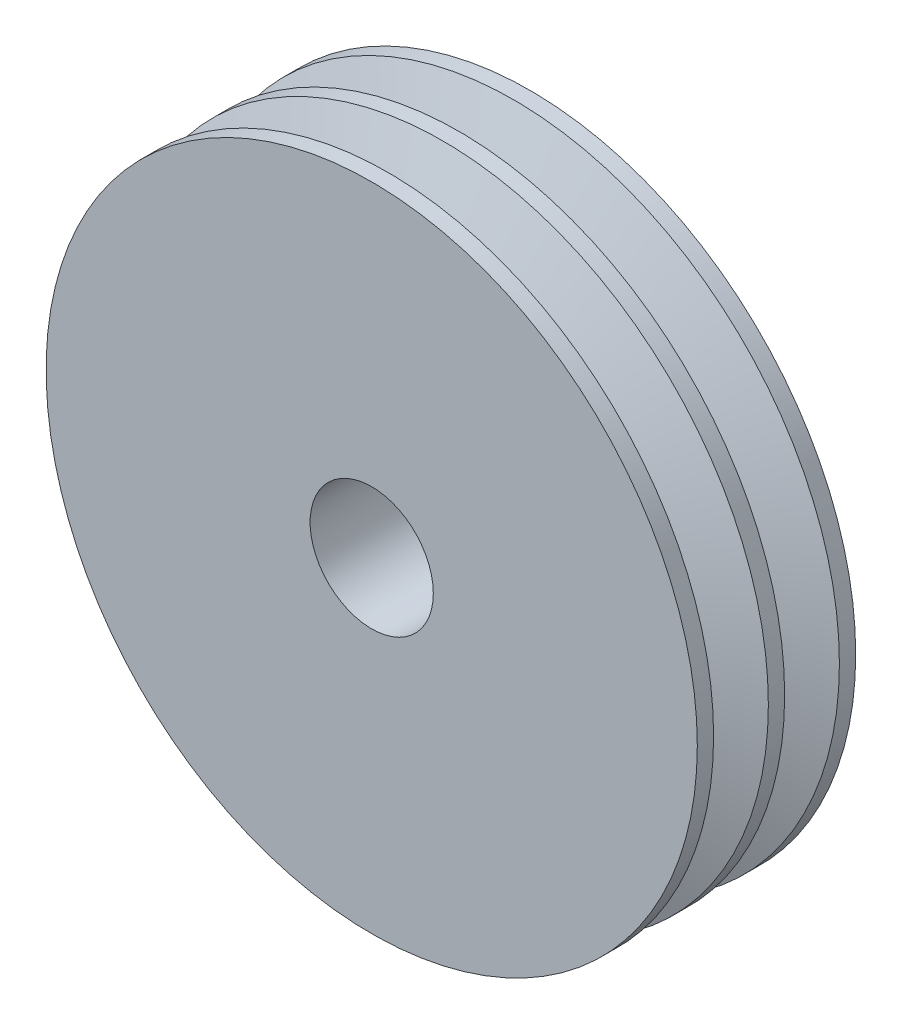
ISO-10303-21;
HEADER;
FILE_DESCRIPTION(('STEP AP214'),'2;1');
FILE_NAME('part.step','',(''),(''),'','','');
FILE_SCHEMA(('AUTOMOTIVE_DESIGN { 1 0 10303 214 1 1 1 1 }'));
ENDSEC;
DATA;
#1=APPLICATION_CONTEXT('core data for automotive mechanical design processes');
#2=APPLICATION_PROTOCOL_DEFINITION('international standard','automotive_design',2000,#1);
#3=PRODUCT_CONTEXT('',#1,'mechanical');
#4=PRODUCT('Part','Part','',(#3));
#5=PRODUCT_RELATED_PRODUCT_CATEGORY('part','',(#4));
#6=PRODUCT_DEFINITION_FORMATION('','',#4);
#7=PRODUCT_DEFINITION_CONTEXT('part definition',#1,'design');
#8=PRODUCT_DEFINITION('design','',#6,#7);
#9=PRODUCT_DEFINITION_SHAPE('','',#8);
#10=(LENGTH_UNIT() NAMED_UNIT(*) SI_UNIT(.MILLI.,.METRE.));
#11=(NAMED_UNIT(*) PLANE_ANGLE_UNIT() SI_UNIT($,.RADIAN.));
#12=(NAMED_UNIT(*) SI_UNIT($,.STERADIAN.) SOLID_ANGLE_UNIT());
#13=UNCERTAINTY_MEASURE_WITH_UNIT(LENGTH_MEASURE(1.E-05),#10,'distance_accuracy_value','');
#14=(GEOMETRIC_REPRESENTATION_CONTEXT(3) GLOBAL_UNCERTAINTY_ASSIGNED_CONTEXT((#13)) GLOBAL_UNIT_ASSIGNED_CONTEXT((#10,
#11,#12)) REPRESENTATION_CONTEXT('',''));
#15=CARTESIAN_POINT('',(0.,0.,0.));
#16=DIRECTION('',(0.,0.,1.));
#17=DIRECTION('',(1.,0.,0.));
#18=AXIS2_PLACEMENT_3D('',#15,#16,#17);
#19=CARTESIAN_POINT('',(0.,0.,3.67693351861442));
#20=DIRECTION('',(0.,0.,-0.999999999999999));
#21=DIRECTION('',(-1.,0.,0.));
#22=AXIS2_PLACEMENT_3D('',#19,#20,#21);
#23=CONICAL_SURFACE('',#22,146.84375,1.22173047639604);
#24=CARTESIAN_POINT('',(0.,0.,12.3439747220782));
#25=DIRECTION('',(0.,0.,0.999999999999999));
#26=DIRECTION('',(1.,0.,0.));
#27=AXIS2_PLACEMENT_3D('',#24,#25,#26);
#28=CIRCLE('',#27,123.03125);
#29=CARTESIAN_POINT('',(-123.03125,0.,12.3439747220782));
#30=VERTEX_POINT('',#29);
#31=EDGE_CURVE('E10',#30,#30,#28,.T.);
#32=CARTESIAN_POINT('',(0.,0.,3.67693351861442));
#33=DIRECTION('',(0.,0.,0.999999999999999));
#34=DIRECTION('',(1.,0.,0.));
#35=AXIS2_PLACEMENT_3D('',#32,#33,#34);
#36=CIRCLE('',#35,146.84375);
#37=CARTESIAN_POINT('',(-146.84375,0.,3.67693351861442));
#38=VERTEX_POINT('',#37);
#39=EDGE_CURVE('E55',#38,#38,#36,.T.);
#40=CARTESIAN_POINT('',(-123.03125,0.,12.3439747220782));
#41=CARTESIAN_POINT('',(-123.279296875,0.,12.2536930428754));
#42=CARTESIAN_POINT('',(-123.52734375,0.,12.1634113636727));
#43=CARTESIAN_POINT('',(-124.0234375,0.,11.9828480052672));
#44=CARTESIAN_POINT('',(-124.271484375,0.,11.8925663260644));
#45=CARTESIAN_POINT('',(-124.767578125,0.,11.7120029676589));
#46=CARTESIAN_POINT('',(-125.015625,0.,11.6217212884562));
#47=CARTESIAN_POINT('',(-125.51171875,0.,11.4411579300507));
#48=CARTESIAN_POINT('',(-125.759765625,0.,11.3508762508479));
#49=CARTESIAN_POINT('',(-126.255859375,0.,11.1703128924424));
#50=CARTESIAN_POINT('',(-126.50390625,0.,11.0800312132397));
#51=CARTESIAN_POINT('',(-127.,0.,10.8994678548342));
#52=CARTESIAN_POINT('',(-127.248046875,0.,10.8091861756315));
#53=CARTESIAN_POINT('',(-127.744140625,0.,10.628622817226));
#54=CARTESIAN_POINT('',(-127.9921875,0.,10.5383411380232));
#55=CARTESIAN_POINT('',(-128.48828125,0.,10.3577777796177));
#56=CARTESIAN_POINT('',(-128.736328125,0.,10.267496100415));
#57=CARTESIAN_POINT('',(-129.232421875,0.,10.0869327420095));
#58=CARTESIAN_POINT('',(-129.48046875,0.,9.99665106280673));
#59=CARTESIAN_POINT('',(-129.9765625,0.,9.81608770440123));
#60=CARTESIAN_POINT('',(-130.224609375,0.,9.72580602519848));
#61=CARTESIAN_POINT('',(-130.720703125,0.,9.54524266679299));
#62=CARTESIAN_POINT('',(-130.96875,0.,9.45496098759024));
#63=CARTESIAN_POINT('',(-131.46484375,0.,9.27439762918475));
#64=CARTESIAN_POINT('',(-131.712890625,0.,9.184115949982));
#65=CARTESIAN_POINT('',(-132.208984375,0.,9.00355259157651));
#66=CARTESIAN_POINT('',(-132.45703125,0.,8.91327091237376));
#67=CARTESIAN_POINT('',(-132.953125,0.,8.73270755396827));
#68=CARTESIAN_POINT('',(-133.201171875,0.,8.64242587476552));
#69=CARTESIAN_POINT('',(-133.697265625,0.,8.46186251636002));
#70=CARTESIAN_POINT('',(-133.9453125,0.,8.37158083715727));
#71=CARTESIAN_POINT('',(-134.44140625,0.,8.19101747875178));
#72=CARTESIAN_POINT('',(-134.689453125,0.,8.10073579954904));
#73=CARTESIAN_POINT('',(-135.185546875,0.,7.92017244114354));
#74=CARTESIAN_POINT('',(-135.43359375,0.,7.82989076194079));
#75=CARTESIAN_POINT('',(-135.9296875,0.,7.6493274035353));
#76=CARTESIAN_POINT('',(-136.177734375,0.,7.55904572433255));
#77=CARTESIAN_POINT('',(-136.673828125,0.,7.37848236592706));
#78=CARTESIAN_POINT('',(-136.921875,0.,7.28820068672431));
#79=CARTESIAN_POINT('',(-137.41796875,0.,7.10763732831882));
#80=CARTESIAN_POINT('',(-137.666015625,0.,7.01735564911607));
#81=CARTESIAN_POINT('',(-138.162109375,0.,6.83679229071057));
#82=CARTESIAN_POINT('',(-138.41015625,0.,6.74651061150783));
#83=CARTESIAN_POINT('',(-138.90625,0.,6.56594725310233));
#84=CARTESIAN_POINT('',(-139.154296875,0.,6.47566557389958));
#85=CARTESIAN_POINT('',(-139.650390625,0.,6.29510221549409));
#86=CARTESIAN_POINT('',(-139.8984375,0.,6.20482053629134));
#87=CARTESIAN_POINT('',(-140.39453125,0.,6.02425717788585));
#88=CARTESIAN_POINT('',(-140.642578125,0.,5.9339754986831));
#89=CARTESIAN_POINT('',(-141.138671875,0.,5.75341214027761));
#90=CARTESIAN_POINT('',(-141.38671875,0.,5.66313046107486));
#91=CARTESIAN_POINT('',(-141.8828125,0.,5.48256710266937));
#92=CARTESIAN_POINT('',(-142.130859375,0.,5.39228542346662));
#93=CARTESIAN_POINT('',(-142.626953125,0.,5.21172206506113));
#94=CARTESIAN_POINT('',(-142.875,0.,5.12144038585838));
#95=CARTESIAN_POINT('',(-143.37109375,0.,4.94087702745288));
#96=CARTESIAN_POINT('',(-143.619140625,0.,4.85059534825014));
#97=CARTESIAN_POINT('',(-144.115234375,0.,4.67003198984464));
#98=CARTESIAN_POINT('',(-144.36328125,0.,4.57975031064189));
#99=CARTESIAN_POINT('',(-144.859375,0.,4.3991869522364));
#100=CARTESIAN_POINT('',(-145.107421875,0.,4.30890527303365));
#101=CARTESIAN_POINT('',(-145.603515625,0.,4.12834191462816));
#102=CARTESIAN_POINT('',(-145.8515625,0.,4.03806023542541));
#103=CARTESIAN_POINT('',(-146.34765625,0.,3.85749687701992));
#104=CARTESIAN_POINT('',(-146.595703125,0.,3.76721519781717));
#105=CARTESIAN_POINT('',(-146.84375,0.,3.67693351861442));
#106=B_SPLINE_CURVE_WITH_KNOTS('',3,(#40,#41,#42,#43,#44,#45,#46,#47,#48,#49,#50,#51,#52,#53,
#54,#55,#56,#57,#58,#59,#60,#61,#62,#63,#64,#65,#66,#67,#68,#69,#70,#71,#72,#73,#74,#75,#76,#77,
#78,#79,#80,#81,#82,#83,#84,#85,#86,#87,#88,#89,#90,#91,#92,#93,#94,#95,#96,#97,#98,#99,#100,
#101,#102,#103,#104,#105),.UNSPECIFIED.,.F.,.F.,(4,2,2,2,2,2,2,2,2,2,2,2,2,2,2,2,2,2,2,2,2,2,2,
2,2,2,2,2,2,2,2,2,4),(0.,0.791897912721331,1.58379582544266,2.37569373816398,3.16759165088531,
3.95948956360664,4.75138747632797,5.54328538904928,6.33518330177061,7.12708121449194,
7.91897912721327,8.7108770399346,9.50277495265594,10.2946728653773,11.0865707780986,
11.8784686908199,12.6703666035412,13.4622645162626,14.2541624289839,15.0460603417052,
15.8379582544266,16.6298561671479,17.4217540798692,18.2136519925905,19.0055499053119,
19.7974478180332,20.5893457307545,21.3812436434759,22.1731415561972,22.9650394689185,
23.7569373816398,24.5488352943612,25.3407332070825),.UNSPECIFIED.);
#107=EDGE_CURVE('BSEAM15',#30,#38,#106,.T.);
#108=ORIENTED_EDGE('',*,*,#31,.F.);
#109=ORIENTED_EDGE('',*,*,#39,.T.);
#110=ORIENTED_EDGE('',*,*,#107,.T.);
#111=ORIENTED_EDGE('',*,*,#107,.F.);
#112=EDGE_LOOP('',(#108,#110,#109,#111));
#113=FACE_BOUND('',#112,.T.);
#114=ADVANCED_FACE('F15',(#113),#23,.T.);
#115=CARTESIAN_POINT('',(0.,0.,0.));
#116=DIRECTION('',(0.,0.,0.999999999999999));
#117=DIRECTION('',(1.,0.,0.));
#118=AXIS2_PLACEMENT_3D('',#115,#116,#117);
#119=CYLINDRICAL_SURFACE('',#118,123.03125);
#120=CARTESIAN_POINT('',(0.,0.,19.6978417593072));
#121=DIRECTION('',(0.,0.,0.999999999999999));
#122=DIRECTION('',(1.,0.,0.));
#123=AXIS2_PLACEMENT_3D('',#120,#121,#122);
#124=CIRCLE('',#123,123.03125);
#125=CARTESIAN_POINT('',(123.03125,0.,19.6978417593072));
#126=VERTEX_POINT('',#125);
#127=EDGE_CURVE('E21',#126,#126,#124,.T.);
#128=ORIENTED_EDGE('',*,*,#127,.F.);
#129=EDGE_LOOP('',(#128));
#130=FACE_BOUND('',#129,.T.);
#131=ORIENTED_EDGE('',*,*,#31,.T.);
#132=EDGE_LOOP('',(#131));
#133=FACE_BOUND('',#132,.T.);
#134=ADVANCED_FACE('F116',(#130,#133),#119,.T.);
#135=CARTESIAN_POINT('',(0.,0.,19.6978417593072));
#136=DIRECTION('',(0.,0.,0.999999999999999));
#137=DIRECTION('',(1.,0.,0.));
#138=AXIS2_PLACEMENT_3D('',#135,#136,#137);
#139=CONICAL_SURFACE('',#138,123.03125,1.22173047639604);
#140=CARTESIAN_POINT('',(0.,0.,28.364882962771));
#141=DIRECTION('',(0.,0.,0.999999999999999));
#142=DIRECTION('',(1.,0.,0.));
#143=AXIS2_PLACEMENT_3D('',#140,#141,#142);
#144=CIRCLE('',#143,146.84375);
#145=CARTESIAN_POINT('',(146.84375,0.,28.364882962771));
#146=VERTEX_POINT('',#145);
#147=EDGE_CURVE('E25',#146,#146,#144,.T.);
#148=CARTESIAN_POINT('',(146.84375,0.,28.364882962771));
#149=CARTESIAN_POINT('',(146.595703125,0.,28.2746012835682));
#150=CARTESIAN_POINT('',(146.34765625,0.,28.1843196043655));
#151=CARTESIAN_POINT('',(145.8515625,0.,28.00375624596));
#152=CARTESIAN_POINT('',(145.603515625,0.,27.9134745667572));
#153=CARTESIAN_POINT('',(145.107421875,0.,27.7329112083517));
#154=CARTESIAN_POINT('',(144.859375,0.,27.642629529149));
#155=CARTESIAN_POINT('',(144.36328125,0.,27.4620661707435));
#156=CARTESIAN_POINT('',(144.115234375,0.,27.3717844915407));
#157=CARTESIAN_POINT('',(143.619140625,0.,27.1912211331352));
#158=CARTESIAN_POINT('',(143.37109375,0.,27.1009394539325));
#159=CARTESIAN_POINT('',(142.875,0.,26.920376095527));
#160=CARTESIAN_POINT('',(142.626953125,0.,26.8300944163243));
#161=CARTESIAN_POINT('',(142.130859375,0.,26.6495310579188));
#162=CARTESIAN_POINT('',(141.8828125,0.,26.559249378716));
#163=CARTESIAN_POINT('',(141.38671875,0.,26.3786860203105));
#164=CARTESIAN_POINT('',(141.138671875,0.,26.2884043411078));
#165=CARTESIAN_POINT('',(140.642578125,0.,26.1078409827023));
#166=CARTESIAN_POINT('',(140.39453125,0.,26.0175593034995));
#167=CARTESIAN_POINT('',(139.8984375,0.,25.836995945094));
#168=CARTESIAN_POINT('',(139.650390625,0.,25.7467142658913));
#169=CARTESIAN_POINT('',(139.154296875,0.,25.5661509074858));
#170=CARTESIAN_POINT('',(138.90625,0.,25.475869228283));
#171=CARTESIAN_POINT('',(138.41015625,0.,25.2953058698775));
#172=CARTESIAN_POINT('',(138.162109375,0.,25.2050241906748));
#173=CARTESIAN_POINT('',(137.666015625,0.,25.0244608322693));
#174=CARTESIAN_POINT('',(137.41796875,0.,24.9341791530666));
#175=CARTESIAN_POINT('',(136.921875,0.,24.7536157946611));
#176=CARTESIAN_POINT('',(136.673828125,0.,24.6633341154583));
#177=CARTESIAN_POINT('',(136.177734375,0.,24.4827707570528));
#178=CARTESIAN_POINT('',(135.9296875,0.,24.3924890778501));
#179=CARTESIAN_POINT('',(135.43359375,0.,24.2119257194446));
#180=CARTESIAN_POINT('',(135.185546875,0.,24.1216440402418));
#181=CARTESIAN_POINT('',(134.689453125,0.,23.9410806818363));
#182=CARTESIAN_POINT('',(134.44140625,0.,23.8507990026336));
#183=CARTESIAN_POINT('',(133.9453125,0.,23.6702356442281));
#184=CARTESIAN_POINT('',(133.697265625,0.,23.5799539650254));
#185=CARTESIAN_POINT('',(133.201171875,0.,23.3993906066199));
#186=CARTESIAN_POINT('',(132.953125,0.,23.3091089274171));
#187=CARTESIAN_POINT('',(132.45703125,0.,23.1285455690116));
#188=CARTESIAN_POINT('',(132.208984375,0.,23.0382638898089));
#189=CARTESIAN_POINT('',(131.712890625,0.,22.8577005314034));
#190=CARTESIAN_POINT('',(131.46484375,0.,22.7674188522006));
#191=CARTESIAN_POINT('',(130.96875,0.,22.5868554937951));
#192=CARTESIAN_POINT('',(130.720703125,0.,22.4965738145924));
#193=CARTESIAN_POINT('',(130.224609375,0.,22.3160104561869));
#194=CARTESIAN_POINT('',(129.9765625,0.,22.2257287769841));
#195=CARTESIAN_POINT('',(129.48046875,0.,22.0451654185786));
#196=CARTESIAN_POINT('',(129.232421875,0.,21.9548837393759));
#197=CARTESIAN_POINT('',(128.736328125,0.,21.7743203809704));
#198=CARTESIAN_POINT('',(128.48828125,0.,21.6840387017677));
#199=CARTESIAN_POINT('',(127.9921875,0.,21.5034753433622));
#200=CARTESIAN_POINT('',(127.744140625,0.,21.4131936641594));
#201=CARTESIAN_POINT('',(127.248046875,0.,21.2326303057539));
#202=CARTESIAN_POINT('',(127.,0.,21.1423486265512));
#203=CARTESIAN_POINT('',(126.50390625,0.,20.9617852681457));
#204=CARTESIAN_POINT('',(126.255859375,0.,20.8715035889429));
#205=CARTESIAN_POINT('',(125.759765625,0.,20.6909402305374));
#206=CARTESIAN_POINT('',(125.51171875,0.,20.6006585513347));
#207=CARTESIAN_POINT('',(125.015625,0.,20.4200951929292));
#208=CARTESIAN_POINT('',(124.767578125,0.,20.3298135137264));
#209=CARTESIAN_POINT('',(124.271484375,0.,20.149250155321));
#210=CARTESIAN_POINT('',(124.0234375,0.,20.0589684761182));
#211=CARTESIAN_POINT('',(123.52734375,0.,19.8784051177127));
#212=CARTESIAN_POINT('',(123.279296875,0.,19.78812343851));
#213=CARTESIAN_POINT('',(123.03125,0.,19.6978417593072));
#214=B_SPLINE_CURVE_WITH_KNOTS('',3,(#148,#149,#150,#151,#152,#153,#154,#155,#156,#157,#158,
#159,#160,#161,#162,#163,#164,#165,#166,#167,#168,#169,#170,#171,#172,#173,#174,#175,#176,#177,
#178,#179,#180,#181,#182,#183,#184,#185,#186,#187,#188,#189,#190,#191,#192,#193,#194,#195,#196,
#197,#198,#199,#200,#201,#202,#203,#204,#205,#206,#207,#208,#209,#210,#211,#212,#213),
.UNSPECIFIED.,.F.,.F.,(4,2,2,2,2,2,2,2,2,2,2,2,2,2,2,2,2,2,2,2,2,2,2,2,2,2,2,2,2,2,2,2,4),(0.,
0.791897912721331,1.58379582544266,2.37569373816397,3.1675916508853,3.95948956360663,
4.75138747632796,5.54328538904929,6.33518330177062,7.12708121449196,7.91897912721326,
8.71087703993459,9.50277495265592,10.2946728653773,11.0865707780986,11.8784686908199,
12.6703666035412,13.4622645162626,14.2541624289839,15.0460603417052,15.8379582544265,
16.6298561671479,17.4217540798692,18.2136519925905,19.0055499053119,19.7974478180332,
20.5893457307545,21.3812436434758,22.1731415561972,22.9650394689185,23.7569373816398,
24.5488352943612,25.3407332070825),.UNSPECIFIED.);
#215=EDGE_CURVE('BSEAM111',#146,#126,#214,.T.);
#216=ORIENTED_EDGE('',*,*,#147,.F.);
#217=ORIENTED_EDGE('',*,*,#127,.T.);
#218=ORIENTED_EDGE('',*,*,#215,.T.);
#219=ORIENTED_EDGE('',*,*,#215,.F.);
#220=EDGE_LOOP('',(#216,#218,#217,#219));
#221=FACE_BOUND('',#220,.T.);
#222=ADVANCED_FACE('F111',(#221),#139,.T.);
#223=CARTESIAN_POINT('',(0.,0.,0.));
#224=DIRECTION('',(0.,0.,0.999999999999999));
#225=DIRECTION('',(1.,0.,0.));
#226=AXIS2_PLACEMENT_3D('',#223,#224,#225);
#227=CYLINDRICAL_SURFACE('',#226,146.84375);
#228=CARTESIAN_POINT('',(0.,0.,35.71875));
#229=DIRECTION('',(0.,0.,0.999999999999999));
#230=DIRECTION('',(1.,0.,0.));
#231=AXIS2_PLACEMENT_3D('',#228,#229,#230);
#232=CIRCLE('',#231,146.84375);
#233=CARTESIAN_POINT('',(146.84375,0.,35.71875));
#234=VERTEX_POINT('',#233);
#235=EDGE_CURVE('E29',#234,#234,#232,.T.);
#236=CARTESIAN_POINT('',(146.84375,0.,35.71875));
#237=CARTESIAN_POINT('',(146.84375,0.,35.6421472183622));
#238=CARTESIAN_POINT('',(146.84375,0.,35.5655444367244));
#239=CARTESIAN_POINT('',(146.84375,0.,35.4123388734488));
#240=CARTESIAN_POINT('',(146.84375,0.,35.335736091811));
#241=CARTESIAN_POINT('',(146.84375,0.,35.1825305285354));
#242=CARTESIAN_POINT('',(146.84375,0.,35.1059277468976));
#243=CARTESIAN_POINT('',(146.84375,0.,34.952722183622));
#244=CARTESIAN_POINT('',(146.84375,0.,34.8761194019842));
#245=CARTESIAN_POINT('',(146.84375,0.,34.7229138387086));
#246=CARTESIAN_POINT('',(146.84375,0.,34.6463110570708));
#247=CARTESIAN_POINT('',(146.84375,0.,34.4931054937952));
#248=CARTESIAN_POINT('',(146.84375,0.,34.4165027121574));
#249=CARTESIAN_POINT('',(146.84375,0.,34.2632971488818));
#250=CARTESIAN_POINT('',(146.84375,0.,34.186694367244));
#251=CARTESIAN_POINT('',(146.84375,0.,34.0334888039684));
#252=CARTESIAN_POINT('',(146.84375,0.,33.9568860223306));
#253=CARTESIAN_POINT('',(146.84375,0.,33.8036804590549));
#254=CARTESIAN_POINT('',(146.84375,0.,33.7270776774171));
#255=CARTESIAN_POINT('',(146.84375,0.,33.5738721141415));
#256=CARTESIAN_POINT('',(146.84375,0.,33.4972693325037));
#257=CARTESIAN_POINT('',(146.84375,0.,33.3440637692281));
#258=CARTESIAN_POINT('',(146.84375,0.,33.2674609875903));
#259=CARTESIAN_POINT('',(146.84375,0.,33.1142554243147));
#260=CARTESIAN_POINT('',(146.84375,0.,33.0376526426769));
#261=CARTESIAN_POINT('',(146.84375,0.,32.8844470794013));
#262=CARTESIAN_POINT('',(146.84375,0.,32.8078442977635));
#263=CARTESIAN_POINT('',(146.84375,0.,32.6546387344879));
#264=CARTESIAN_POINT('',(146.84375,0.,32.5780359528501));
#265=CARTESIAN_POINT('',(146.84375,0.,32.4248303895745));
#266=CARTESIAN_POINT('',(146.84375,0.,32.3482276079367));
#267=CARTESIAN_POINT('',(146.84375,0.,32.1950220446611));
#268=CARTESIAN_POINT('',(146.84375,0.,32.1184192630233));
#269=CARTESIAN_POINT('',(146.84375,0.,31.9652136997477));
#270=CARTESIAN_POINT('',(146.84375,0.,31.8886109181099));
#271=CARTESIAN_POINT('',(146.84375,0.,31.7354053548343));
#272=CARTESIAN_POINT('',(146.84375,0.,31.6588025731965));
#273=CARTESIAN_POINT('',(146.84375,0.,31.5055970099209));
#274=CARTESIAN_POINT('',(146.84375,0.,31.4289942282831));
#275=CARTESIAN_POINT('',(146.84375,0.,31.2757886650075));
#276=CARTESIAN_POINT('',(146.84375,0.,31.1991858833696));
#277=CARTESIAN_POINT('',(146.84375,0.,31.045980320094));
#278=CARTESIAN_POINT('',(146.84375,0.,30.9693775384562));
#279=CARTESIAN_POINT('',(146.84375,0.,30.8161719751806));
#280=CARTESIAN_POINT('',(146.84375,0.,30.7395691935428));
#281=CARTESIAN_POINT('',(146.84375,0.,30.5863636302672));
#282=CARTESIAN_POINT('',(146.84375,0.,30.5097608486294));
#283=CARTESIAN_POINT('',(146.84375,0.,30.3565552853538));
#284=CARTESIAN_POINT('',(146.84375,0.,30.279952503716));
#285=CARTESIAN_POINT('',(146.84375,0.,30.1267469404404));
#286=CARTESIAN_POINT('',(146.84375,0.,30.0501441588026));
#287=CARTESIAN_POINT('',(146.84375,0.,29.896938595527));
#288=CARTESIAN_POINT('',(146.84375,0.,29.8203358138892));
#289=CARTESIAN_POINT('',(146.84375,0.,29.6671302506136));
#290=CARTESIAN_POINT('',(146.84375,0.,29.5905274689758));
#291=CARTESIAN_POINT('',(146.84375,0.,29.4373219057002));
#292=CARTESIAN_POINT('',(146.84375,0.,29.3607191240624));
#293=CARTESIAN_POINT('',(146.84375,0.,29.2075135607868));
#294=CARTESIAN_POINT('',(146.84375,0.,29.130910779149));
#295=CARTESIAN_POINT('',(146.84375,0.,28.9777052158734));
#296=CARTESIAN_POINT('',(146.84375,0.,28.9011024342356));
#297=CARTESIAN_POINT('',(146.84375,0.,28.74789687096));
#298=CARTESIAN_POINT('',(146.84375,0.,28.6712940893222));
#299=CARTESIAN_POINT('',(146.84375,0.,28.5180885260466));
#300=CARTESIAN_POINT('',(146.84375,0.,28.4414857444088));
#301=CARTESIAN_POINT('',(146.84375,0.,28.364882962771));
#302=B_SPLINE_CURVE_WITH_KNOTS('',3,(#236,#237,#238,#239,#240,#241,#242,#243,#244,#245,#246,
#247,#248,#249,#250,#251,#252,#253,#254,#255,#256,#257,#258,#259,#260,#261,#262,#263,#264,#265,
#266,#267,#268,#269,#270,#271,#272,#273,#274,#275,#276,#277,#278,#279,#280,#281,#282,#283,#284,
#285,#286,#287,#288,#289,#290,#291,#292,#293,#294,#295,#296,#297,#298,#299,#300,#301),
.UNSPECIFIED.,.F.,.F.,(4,2,2,2,2,2,2,2,2,2,2,2,2,2,2,2,2,2,2,2,2,2,2,2,2,2,2,2,2,2,2,2,4),(0.,
0.229808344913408,0.459616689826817,0.689425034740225,0.919233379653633,1.14904172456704,
1.37885006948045,1.60865841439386,1.83846675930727,2.06827510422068,2.29808344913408,
2.52789179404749,2.7577001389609,2.98750848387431,3.21731682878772,3.44712517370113,
3.67693351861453,3.90674186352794,4.13655020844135,4.36635855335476,4.59616689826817,
4.82597524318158,5.05578358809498,5.28559193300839,5.5154002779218,5.74520862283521,
5.97501696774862,6.20482531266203,6.43463365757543,6.66444200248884,6.89425034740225,
7.12405869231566,7.35386703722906),.UNSPECIFIED.);
#303=EDGE_CURVE('BSEAM105',#234,#146,#302,.T.);
#304=ORIENTED_EDGE('',*,*,#235,.F.);
#305=ORIENTED_EDGE('',*,*,#147,.T.);
#306=ORIENTED_EDGE('',*,*,#303,.T.);
#307=ORIENTED_EDGE('',*,*,#303,.F.);
#308=EDGE_LOOP('',(#304,#306,#305,#307));
#309=FACE_BOUND('',#308,.T.);
#310=ADVANCED_FACE('F105',(#309),#227,.T.);
#311=CARTESIAN_POINT('',(0.,27.78125,35.71875));
#312=DIRECTION('',(0.,0.,-0.999999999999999));
#313=DIRECTION('',(-1.,0.,0.));
#314=AXIS2_PLACEMENT_3D('',#311,#312,#313);
#315=PLANE('',#314);
#316=CARTESIAN_POINT('',(0.,0.,35.71875));
#317=DIRECTION('',(0.,0.,0.999999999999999));
#318=DIRECTION('',(1.,0.,0.));
#319=AXIS2_PLACEMENT_3D('',#316,#317,#318);
#320=CIRCLE('',#319,27.78125);
#321=CARTESIAN_POINT('',(27.78125,0.,35.71875));
#322=VERTEX_POINT('',#321);
#323=EDGE_CURVE('E34',#322,#322,#320,.T.);
#324=ORIENTED_EDGE('',*,*,#323,.F.);
#325=EDGE_LOOP('',(#324));
#326=FACE_BOUND('',#325,.T.);
#327=ORIENTED_EDGE('',*,*,#235,.T.);
#328=EDGE_LOOP('',(#327));
#329=FACE_BOUND('',#328,.T.);
#330=ADVANCED_FACE('F99',(#326,#329),#315,.F.);
#331=CARTESIAN_POINT('',(0.,0.,0.));
#332=DIRECTION('',(0.,0.,0.999999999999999));
#333=DIRECTION('',(1.,0.,0.));
#334=AXIS2_PLACEMENT_3D('',#331,#332,#333);
#335=CYLINDRICAL_SURFACE('',#334,27.78125);
#336=CARTESIAN_POINT('',(0.,0.,-35.71875));
#337=DIRECTION('',(0.,0.,0.999999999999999));
#338=DIRECTION('',(1.,0.,0.));
#339=AXIS2_PLACEMENT_3D('',#336,#337,#338);
#340=CIRCLE('',#339,27.78125);
#341=CARTESIAN_POINT('',(27.78125,0.,-35.71875));
#342=VERTEX_POINT('',#341);
#343=EDGE_CURVE('E37',#342,#342,#340,.T.);
#344=CARTESIAN_POINT('',(27.78125,0.,-35.71875));
#345=CARTESIAN_POINT('',(27.78125,0.,-34.974609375));
#346=CARTESIAN_POINT('',(27.78125,0.,-34.23046875));
#347=CARTESIAN_POINT('',(27.78125,0.,-32.7421875));
#348=CARTESIAN_POINT('',(27.78125,0.,-31.998046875));
#349=CARTESIAN_POINT('',(27.78125,0.,-30.509765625));
#350=CARTESIAN_POINT('',(27.78125,0.,-29.765625));
#351=CARTESIAN_POINT('',(27.78125,0.,-28.27734375));
#352=CARTESIAN_POINT('',(27.78125,0.,-27.533203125));
#353=CARTESIAN_POINT('',(27.78125,0.,-26.044921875));
#354=CARTESIAN_POINT('',(27.78125,0.,-25.30078125));
#355=CARTESIAN_POINT('',(27.78125,0.,-23.8125));
#356=CARTESIAN_POINT('',(27.78125,0.,-23.068359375));
#357=CARTESIAN_POINT('',(27.78125,0.,-21.580078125));
#358=CARTESIAN_POINT('',(27.78125,0.,-20.8359375));
#359=CARTESIAN_POINT('',(27.78125,0.,-19.34765625));
#360=CARTESIAN_POINT('',(27.78125,0.,-18.603515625));
#361=CARTESIAN_POINT('',(27.78125,0.,-17.115234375));
#362=CARTESIAN_POINT('',(27.78125,0.,-16.37109375));
#363=CARTESIAN_POINT('',(27.78125,0.,-14.8828125));
#364=CARTESIAN_POINT('',(27.78125,0.,-14.138671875));
#365=CARTESIAN_POINT('',(27.78125,0.,-12.650390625));
#366=CARTESIAN_POINT('',(27.78125,0.,-11.90625));
#367=CARTESIAN_POINT('',(27.78125,0.,-10.41796875));
#368=CARTESIAN_POINT('',(27.78125,0.,-9.67382812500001));
#369=CARTESIAN_POINT('',(27.78125,0.,-8.18554687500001));
#370=CARTESIAN_POINT('',(27.78125,0.,-7.44140625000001));
#371=CARTESIAN_POINT('',(27.78125,0.,-5.95312500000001));
#372=CARTESIAN_POINT('',(27.78125,0.,-5.20898437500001));
#373=CARTESIAN_POINT('',(27.78125,0.,-3.72070312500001));
#374=CARTESIAN_POINT('',(27.78125,0.,-2.97656250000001));
#375=CARTESIAN_POINT('',(27.78125,0.,-1.48828125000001));
#376=CARTESIAN_POINT('',(27.78125,0.,-0.744140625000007));
#377=CARTESIAN_POINT('',(27.78125,0.,0.744140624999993));
#378=CARTESIAN_POINT('',(27.78125,0.,1.48828124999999));
#379=CARTESIAN_POINT('',(27.78125,0.,2.97656249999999));
#380=CARTESIAN_POINT('',(27.78125,0.,3.72070312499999));
#381=CARTESIAN_POINT('',(27.78125,0.,5.208984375));
#382=CARTESIAN_POINT('',(27.78125,0.,5.953125));
#383=CARTESIAN_POINT('',(27.78125,0.,7.44140625));
#384=CARTESIAN_POINT('',(27.78125,0.,8.185546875));
#385=CARTESIAN_POINT('',(27.78125,0.,9.673828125));
#386=CARTESIAN_POINT('',(27.78125,0.,10.41796875));
#387=CARTESIAN_POINT('',(27.78125,0.,11.90625));
#388=CARTESIAN_POINT('',(27.78125,0.,12.650390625));
#389=CARTESIAN_POINT('',(27.78125,0.,14.138671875));
#390=CARTESIAN_POINT('',(27.78125,0.,14.8828125));
#391=CARTESIAN_POINT('',(27.78125,0.,16.37109375));
#392=CARTESIAN_POINT('',(27.78125,0.,17.115234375));
#393=CARTESIAN_POINT('',(27.78125,0.,18.603515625));
#394=CARTESIAN_POINT('',(27.78125,0.,19.34765625));
#395=CARTESIAN_POINT('',(27.78125,0.,20.8359375));
#396=CARTESIAN_POINT('',(27.78125,0.,21.580078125));
#397=CARTESIAN_POINT('',(27.78125,0.,23.068359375));
#398=CARTESIAN_POINT('',(27.78125,0.,23.8125));
#399=CARTESIAN_POINT('',(27.78125,0.,25.30078125));
#400=CARTESIAN_POINT('',(27.78125,0.,26.044921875));
#401=CARTESIAN_POINT('',(27.78125,0.,27.533203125));
#402=CARTESIAN_POINT('',(27.78125,0.,28.27734375));
#403=CARTESIAN_POINT('',(27.78125,0.,29.765625));
#404=CARTESIAN_POINT('',(27.78125,0.,30.509765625));
#405=CARTESIAN_POINT('',(27.78125,0.,31.998046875));
#406=CARTESIAN_POINT('',(27.78125,0.,32.7421875));
#407=CARTESIAN_POINT('',(27.78125,0.,34.23046875));
#408=CARTESIAN_POINT('',(27.78125,0.,34.974609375));
#409=CARTESIAN_POINT('',(27.78125,0.,35.71875));
#410=B_SPLINE_CURVE_WITH_KNOTS('',3,(#344,#345,#346,#347,#348,#349,#350,#351,#352,#353,#354,
#355,#356,#357,#358,#359,#360,#361,#362,#363,#364,#365,#366,#367,#368,#369,#370,#371,#372,#373,
#374,#375,#376,#377,#378,#379,#380,#381,#382,#383,#384,#385,#386,#387,#388,#389,#390,#391,#392,
#393,#394,#395,#396,#397,#398,#399,#400,#401,#402,#403,#404,#405,#406,#407,#408,#409),
.UNSPECIFIED.,.F.,.F.,(4,2,2,2,2,2,2,2,2,2,2,2,2,2,2,2,2,2,2,2,2,2,2,2,2,2,2,2,2,2,2,2,4),(0.,
2.232421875,4.46484375,6.69726562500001,8.92968750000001,11.162109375,13.39453125,15.626953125,
17.859375,20.091796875,22.32421875,24.556640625,26.7890625,29.021484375,31.25390625,
33.486328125,35.71875,37.951171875,40.18359375,42.416015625,44.6484375,46.880859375,49.11328125,
51.345703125,53.578125,55.810546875,58.04296875,60.275390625,62.5078125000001,64.7402343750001,
66.9726562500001,69.2050781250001,71.4375000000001),.UNSPECIFIED.);
#411=EDGE_CURVE('BSEAM93',#342,#322,#410,.T.);
#412=ORIENTED_EDGE('',*,*,#343,.F.);
#413=ORIENTED_EDGE('',*,*,#323,.T.);
#414=ORIENTED_EDGE('',*,*,#411,.T.);
#415=ORIENTED_EDGE('',*,*,#411,.F.);
#416=EDGE_LOOP('',(#412,#414,#413,#415));
#417=FACE_BOUND('',#416,.T.);
#418=ADVANCED_FACE('F93',(#417),#335,.F.);
#419=CARTESIAN_POINT('',(0.,27.78125,-35.71875));
#420=DIRECTION('',(0.,0.,0.999999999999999));
#421=DIRECTION('',(1.,0.,0.));
#422=AXIS2_PLACEMENT_3D('',#419,#420,#421);
#423=PLANE('',#422);
#424=CARTESIAN_POINT('',(0.,0.,-35.71875));
#425=DIRECTION('',(0.,0.,0.999999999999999));
#426=DIRECTION('',(1.,0.,0.));
#427=AXIS2_PLACEMENT_3D('',#424,#425,#426);
#428=CIRCLE('',#427,146.84375);
#429=CARTESIAN_POINT('',(146.84375,0.,-35.71875));
#430=VERTEX_POINT('',#429);
#431=EDGE_CURVE('E40',#430,#430,#428,.T.);
#432=ORIENTED_EDGE('',*,*,#431,.F.);
#433=EDGE_LOOP('',(#432));
#434=FACE_BOUND('',#433,.T.);
#435=ORIENTED_EDGE('',*,*,#343,.T.);
#436=EDGE_LOOP('',(#435));
#437=FACE_BOUND('',#436,.T.);
#438=ADVANCED_FACE('F87',(#434,#437),#423,.F.);
#439=CARTESIAN_POINT('',(0.,0.,0.));
#440=DIRECTION('',(0.,0.,0.999999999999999));
#441=DIRECTION('',(1.,0.,0.));
#442=AXIS2_PLACEMENT_3D('',#439,#440,#441);
#443=CYLINDRICAL_SURFACE('',#442,146.84375);
#444=CARTESIAN_POINT('',(0.,0.,-28.364882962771));
#445=DIRECTION('',(0.,0.,0.999999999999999));
#446=DIRECTION('',(1.,0.,0.));
#447=AXIS2_PLACEMENT_3D('',#444,#445,#446);
#448=CIRCLE('',#447,146.84375);
#449=CARTESIAN_POINT('',(146.84375,0.,-28.364882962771));
#450=VERTEX_POINT('',#449);
#451=EDGE_CURVE('E43',#450,#450,#448,.T.);
#452=CARTESIAN_POINT('',(146.84375,0.,-28.364882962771));
#453=CARTESIAN_POINT('',(146.84375,0.,-28.4414857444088));
#454=CARTESIAN_POINT('',(146.84375,0.,-28.5180885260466));
#455=CARTESIAN_POINT('',(146.84375,0.,-28.6712940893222));
#456=CARTESIAN_POINT('',(146.84375,0.,-28.74789687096));
#457=CARTESIAN_POINT('',(146.84375,0.,-28.9011024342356));
#458=CARTESIAN_POINT('',(146.84375,0.,-28.9777052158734));
#459=CARTESIAN_POINT('',(146.84375,0.,-29.130910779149));
#460=CARTESIAN_POINT('',(146.84375,0.,-29.2075135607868));
#461=CARTESIAN_POINT('',(146.84375,0.,-29.3607191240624));
#462=CARTESIAN_POINT('',(146.84375,0.,-29.4373219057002));
#463=CARTESIAN_POINT('',(146.84375,0.,-29.5905274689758));
#464=CARTESIAN_POINT('',(146.84375,0.,-29.6671302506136));
#465=CARTESIAN_POINT('',(146.84375,0.,-29.8203358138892));
#466=CARTESIAN_POINT('',(146.84375,0.,-29.896938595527));
#467=CARTESIAN_POINT('',(146.84375,0.,-30.0501441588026));
#468=CARTESIAN_POINT('',(146.84375,0.,-30.1267469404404));
#469=CARTESIAN_POINT('',(146.84375,0.,-30.279952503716));
#470=CARTESIAN_POINT('',(146.84375,0.,-30.3565552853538));
#471=CARTESIAN_POINT('',(146.84375,0.,-30.5097608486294));
#472=CARTESIAN_POINT('',(146.84375,0.,-30.5863636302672));
#473=CARTESIAN_POINT('',(146.84375,0.,-30.7395691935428));
#474=CARTESIAN_POINT('',(146.84375,0.,-30.8161719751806));
#475=CARTESIAN_POINT('',(146.84375,0.,-30.9693775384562));
#476=CARTESIAN_POINT('',(146.84375,0.,-31.0459803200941));
#477=CARTESIAN_POINT('',(146.84375,0.,-31.1991858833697));
#478=CARTESIAN_POINT('',(146.84375,0.,-31.2757886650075));
#479=CARTESIAN_POINT('',(146.84375,0.,-31.4289942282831));
#480=CARTESIAN_POINT('',(146.84375,0.,-31.5055970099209));
#481=CARTESIAN_POINT('',(146.84375,0.,-31.6588025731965));
#482=CARTESIAN_POINT('',(146.84375,0.,-31.7354053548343));
#483=CARTESIAN_POINT('',(146.84375,0.,-31.8886109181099));
#484=CARTESIAN_POINT('',(146.84375,0.,-31.9652136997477));
#485=CARTESIAN_POINT('',(146.84375,0.,-32.1184192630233));
#486=CARTESIAN_POINT('',(146.84375,0.,-32.1950220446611));
#487=CARTESIAN_POINT('',(146.84375,0.,-32.3482276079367));
#488=CARTESIAN_POINT('',(146.84375,0.,-32.4248303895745));
#489=CARTESIAN_POINT('',(146.84375,0.,-32.5780359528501));
#490=CARTESIAN_POINT('',(146.84375,0.,-32.6546387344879));
#491=CARTESIAN_POINT('',(146.84375,0.,-32.8078442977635));
#492=CARTESIAN_POINT('',(146.84375,0.,-32.8844470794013));
#493=CARTESIAN_POINT('',(146.84375,0.,-33.0376526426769));
#494=CARTESIAN_POINT('',(146.84375,0.,-33.1142554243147));
#495=CARTESIAN_POINT('',(146.84375,0.,-33.2674609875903));
#496=CARTESIAN_POINT('',(146.84375,0.,-33.3440637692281));
#497=CARTESIAN_POINT('',(146.84375,0.,-33.4972693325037));
#498=CARTESIAN_POINT('',(146.84375,0.,-33.5738721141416));
#499=CARTESIAN_POINT('',(146.84375,0.,-33.7270776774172));
#500=CARTESIAN_POINT('',(146.84375,0.,-33.803680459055));
#501=CARTESIAN_POINT('',(146.84375,0.,-33.9568860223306));
#502=CARTESIAN_POINT('',(146.84375,0.,-34.0334888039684));
#503=CARTESIAN_POINT('',(146.84375,0.,-34.186694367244));
#504=CARTESIAN_POINT('',(146.84375,0.,-34.2632971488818));
#505=CARTESIAN_POINT('',(146.84375,0.,-34.4165027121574));
#506=CARTESIAN_POINT('',(146.84375,0.,-34.4931054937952));
#507=CARTESIAN_POINT('',(146.84375,0.,-34.6463110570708));
#508=CARTESIAN_POINT('',(146.84375,0.,-34.7229138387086));
#509=CARTESIAN_POINT('',(146.84375,0.,-34.8761194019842));
#510=CARTESIAN_POINT('',(146.84375,0.,-34.952722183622));
#511=CARTESIAN_POINT('',(146.84375,0.,-35.1059277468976));
#512=CARTESIAN_POINT('',(146.84375,0.,-35.1825305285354));
#513=CARTESIAN_POINT('',(146.84375,0.,-35.335736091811));
#514=CARTESIAN_POINT('',(146.84375,0.,-35.4123388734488));
#515=CARTESIAN_POINT('',(146.84375,0.,-35.5655444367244));
#516=CARTESIAN_POINT('',(146.84375,0.,-35.6421472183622));
#517=CARTESIAN_POINT('',(146.84375,0.,-35.71875));
#518=B_SPLINE_CURVE_WITH_KNOTS('',3,(#452,#453,#454,#455,#456,#457,#458,#459,#460,#461,#462,
#463,#464,#465,#466,#467,#468,#469,#470,#471,#472,#473,#474,#475,#476,#477,#478,#479,#480,#481,
#482,#483,#484,#485,#486,#487,#488,#489,#490,#491,#492,#493,#494,#495,#496,#497,#498,#499,#500,
#501,#502,#503,#504,#505,#506,#507,#508,#509,#510,#511,#512,#513,#514,#515,#516,#517),
.UNSPECIFIED.,.F.,.F.,(4,2,2,2,2,2,2,2,2,2,2,2,2,2,2,2,2,2,2,2,2,2,2,2,2,2,2,2,2,2,2,2,4),(0.,
0.229808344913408,0.459616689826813,0.689425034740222,0.91923337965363,1.14904172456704,
1.37885006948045,1.60865841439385,1.83846675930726,2.06827510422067,2.29808344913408,
2.52789179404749,2.7577001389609,2.98750848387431,3.21731682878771,3.44712517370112,
3.67693351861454,3.90674186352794,4.13655020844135,4.36635855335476,4.59616689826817,
4.82597524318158,5.05578358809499,5.2855919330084,5.5154002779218,5.74520862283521,
5.97501696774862,6.20482531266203,6.43463365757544,6.66444200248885,6.89425034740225,
7.12405869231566,7.35386703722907),.UNSPECIFIED.);
#519=EDGE_CURVE('BSEAM81',#450,#430,#518,.T.);
#520=ORIENTED_EDGE('',*,*,#451,.F.);
#521=ORIENTED_EDGE('',*,*,#431,.T.);
#522=ORIENTED_EDGE('',*,*,#519,.T.);
#523=ORIENTED_EDGE('',*,*,#519,.F.);
#524=EDGE_LOOP('',(#520,#522,#521,#523));
#525=FACE_BOUND('',#524,.T.);
#526=ADVANCED_FACE('F81',(#525),#443,.T.);
#527=CARTESIAN_POINT('',(0.,0.,-28.364882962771));
#528=DIRECTION('',(0.,0.,-0.999999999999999));
#529=DIRECTION('',(-1.,0.,0.));
#530=AXIS2_PLACEMENT_3D('',#527,#528,#529);
#531=CONICAL_SURFACE('',#530,146.84375,1.22173047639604);
#532=CARTESIAN_POINT('',(0.,0.,-19.6978417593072));
#533=DIRECTION('',(0.,0.,0.999999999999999));
#534=DIRECTION('',(1.,0.,0.));
#535=AXIS2_PLACEMENT_3D('',#532,#533,#534);
#536=CIRCLE('',#535,123.03125);
#537=CARTESIAN_POINT('',(123.03125,0.,-19.6978417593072));
#538=VERTEX_POINT('',#537);
#539=EDGE_CURVE('E46',#538,#538,#536,.T.);
#540=ORIENTED_EDGE('',*,*,#539,.F.);
#541=EDGE_LOOP('',(#540));
#542=FACE_BOUND('',#541,.T.);
#543=ORIENTED_EDGE('',*,*,#451,.T.);
#544=EDGE_LOOP('',(#543));
#545=FACE_BOUND('',#544,.T.);
#546=ADVANCED_FACE('F75',(#542,#545),#531,.T.);
#547=CARTESIAN_POINT('',(0.,0.,0.));
#548=DIRECTION('',(0.,0.,0.999999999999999));
#549=DIRECTION('',(1.,0.,0.));
#550=AXIS2_PLACEMENT_3D('',#547,#548,#549);
#551=CYLINDRICAL_SURFACE('',#550,123.03125);
#552=CARTESIAN_POINT('',(0.,0.,-12.3439747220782));
#553=DIRECTION('',(0.,0.,0.999999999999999));
#554=DIRECTION('',(1.,0.,0.));
#555=AXIS2_PLACEMENT_3D('',#552,#553,#554);
#556=CIRCLE('',#555,123.03125);
#557=CARTESIAN_POINT('',(123.03125,0.,-12.3439747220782));
#558=VERTEX_POINT('',#557);
#559=EDGE_CURVE('E49',#558,#558,#556,.T.);
#560=CARTESIAN_POINT('',(123.03125,0.,-12.3439747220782));
#561=CARTESIAN_POINT('',(123.03125,0.,-12.420577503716));
#562=CARTESIAN_POINT('',(123.03125,0.,-12.4971802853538));
#563=CARTESIAN_POINT('',(123.03125,0.,-12.6503858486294));
#564=CARTESIAN_POINT('',(123.03125,0.,-12.7269886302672));
#565=CARTESIAN_POINT('',(123.03125,0.,-12.8801941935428));
#566=CARTESIAN_POINT('',(123.03125,0.,-12.9567969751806));
#567=CARTESIAN_POINT('',(123.03125,0.,-13.1100025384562));
#568=CARTESIAN_POINT('',(123.03125,0.,-13.186605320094));
#569=CARTESIAN_POINT('',(123.03125,0.,-13.3398108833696));
#570=CARTESIAN_POINT('',(123.03125,0.,-13.4164136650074));
#571=CARTESIAN_POINT('',(123.03125,0.,-13.569619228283));
#572=CARTESIAN_POINT('',(123.03125,0.,-13.6462220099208));
#573=CARTESIAN_POINT('',(123.03125,0.,-13.7994275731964));
#574=CARTESIAN_POINT('',(123.03125,0.,-13.8760303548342));
#575=CARTESIAN_POINT('',(123.03125,0.,-14.0292359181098));
#576=CARTESIAN_POINT('',(123.03125,0.,-14.1058386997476));
#577=CARTESIAN_POINT('',(123.03125,0.,-14.2590442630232));
#578=CARTESIAN_POINT('',(123.03125,0.,-14.335647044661));
#579=CARTESIAN_POINT('',(123.03125,0.,-14.4888526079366));
#580=CARTESIAN_POINT('',(123.03125,0.,-14.5654553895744));
#581=CARTESIAN_POINT('',(123.03125,0.,-14.71866095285));
#582=CARTESIAN_POINT('',(123.03125,0.,-14.7952637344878));
#583=CARTESIAN_POINT('',(123.03125,0.,-14.9484692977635));
#584=CARTESIAN_POINT('',(123.03125,0.,-15.0250720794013));
#585=CARTESIAN_POINT('',(123.03125,0.,-15.1782776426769));
#586=CARTESIAN_POINT('',(123.03125,0.,-15.2548804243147));
#587=CARTESIAN_POINT('',(123.03125,0.,-15.4080859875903));
#588=CARTESIAN_POINT('',(123.03125,0.,-15.4846887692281));
#589=CARTESIAN_POINT('',(123.03125,0.,-15.6378943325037));
#590=CARTESIAN_POINT('',(123.03125,0.,-15.7144971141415));
#591=CARTESIAN_POINT('',(123.03125,0.,-15.8677026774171));
#592=CARTESIAN_POINT('',(123.03125,0.,-15.9443054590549));
#593=CARTESIAN_POINT('',(123.03125,0.,-16.0975110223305));
#594=CARTESIAN_POINT('',(123.03125,0.,-16.1741138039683));
#595=CARTESIAN_POINT('',(123.03125,0.,-16.3273193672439));
#596=CARTESIAN_POINT('',(123.03125,0.,-16.4039221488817));
#597=CARTESIAN_POINT('',(123.03125,0.,-16.5571277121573));
#598=CARTESIAN_POINT('',(123.03125,0.,-16.6337304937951));
#599=CARTESIAN_POINT('',(123.03125,0.,-16.7869360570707));
#600=CARTESIAN_POINT('',(123.03125,0.,-16.8635388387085));
#601=CARTESIAN_POINT('',(123.03125,0.,-17.0167444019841));
#602=CARTESIAN_POINT('',(123.03125,0.,-17.0933471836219));
#603=CARTESIAN_POINT('',(123.03125,0.,-17.2465527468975));
#604=CARTESIAN_POINT('',(123.03125,0.,-17.3231555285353));
#605=CARTESIAN_POINT('',(123.03125,0.,-17.4763610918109));
#606=CARTESIAN_POINT('',(123.03125,0.,-17.5529638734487));
#607=CARTESIAN_POINT('',(123.03125,0.,-17.7061694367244));
#608=CARTESIAN_POINT('',(123.03125,0.,-17.7827722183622));
#609=CARTESIAN_POINT('',(123.03125,0.,-17.9359777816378));
#610=CARTESIAN_POINT('',(123.03125,0.,-18.0125805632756));
#611=CARTESIAN_POINT('',(123.03125,0.,-18.1657861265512));
#612=CARTESIAN_POINT('',(123.03125,0.,-18.242388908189));
#613=CARTESIAN_POINT('',(123.03125,0.,-18.3955944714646));
#614=CARTESIAN_POINT('',(123.03125,0.,-18.4721972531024));
#615=CARTESIAN_POINT('',(123.03125,0.,-18.625402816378));
#616=CARTESIAN_POINT('',(123.03125,0.,-18.7020055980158));
#617=CARTESIAN_POINT('',(123.03125,0.,-18.8552111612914));
#618=CARTESIAN_POINT('',(123.03125,0.,-18.9318139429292));
#619=CARTESIAN_POINT('',(123.03125,0.,-19.0850195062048));
#620=CARTESIAN_POINT('',(123.03125,0.,-19.1616222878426));
#621=CARTESIAN_POINT('',(123.03125,0.,-19.3148278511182));
#622=CARTESIAN_POINT('',(123.03125,0.,-19.391430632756));
#623=CARTESIAN_POINT('',(123.03125,0.,-19.5446361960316));
#624=CARTESIAN_POINT('',(123.03125,0.,-19.6212389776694));
#625=CARTESIAN_POINT('',(123.03125,0.,-19.6978417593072));
#626=B_SPLINE_CURVE_WITH_KNOTS('',3,(#560,#561,#562,#563,#564,#565,#566,#567,#568,#569,#570,
#571,#572,#573,#574,#575,#576,#577,#578,#579,#580,#581,#582,#583,#584,#585,#586,#587,#588,#589,
#590,#591,#592,#593,#594,#595,#596,#597,#598,#599,#600,#601,#602,#603,#604,#605,#606,#607,#608,
#609,#610,#611,#612,#613,#614,#615,#616,#617,#618,#619,#620,#621,#622,#623,#624,#625),
.UNSPECIFIED.,.F.,.F.,(4,2,2,2,2,2,2,2,2,2,2,2,2,2,2,2,2,2,2,2,2,2,2,2,2,2,2,2,2,2,2,2,4),(0.,
0.229808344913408,0.459616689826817,0.689425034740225,0.919233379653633,1.14904172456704,
1.37885006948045,1.60865841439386,1.83846675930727,2.06827510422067,2.29808344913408,
2.52789179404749,2.7577001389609,2.98750848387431,3.21731682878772,3.44712517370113,
3.67693351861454,3.90674186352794,4.13655020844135,4.36635855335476,4.59616689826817,
4.82597524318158,5.05578358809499,5.28559193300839,5.5154002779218,5.74520862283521,
5.97501696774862,6.20482531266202,6.43463365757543,6.66444200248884,6.89425034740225,
7.12405869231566,7.35386703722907),.UNSPECIFIED.);
#627=EDGE_CURVE('BSEAM69',#558,#538,#626,.T.);
#628=ORIENTED_EDGE('',*,*,#559,.F.);
#629=ORIENTED_EDGE('',*,*,#539,.T.);
#630=ORIENTED_EDGE('',*,*,#627,.T.);
#631=ORIENTED_EDGE('',*,*,#627,.F.);
#632=EDGE_LOOP('',(#628,#630,#629,#631));
#633=FACE_BOUND('',#632,.T.);
#634=ADVANCED_FACE('F69',(#633),#551,.T.);
#635=CARTESIAN_POINT('',(0.,0.,-12.3439747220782));
#636=DIRECTION('',(0.,0.,0.999999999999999));
#637=DIRECTION('',(1.,0.,0.));
#638=AXIS2_PLACEMENT_3D('',#635,#636,#637);
#639=CONICAL_SURFACE('',#638,123.03125,1.22173047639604);
#640=CARTESIAN_POINT('',(0.,0.,-3.67693351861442));
#641=DIRECTION('',(0.,0.,0.999999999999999));
#642=DIRECTION('',(1.,0.,0.));
#643=AXIS2_PLACEMENT_3D('',#640,#641,#642);
#644=CIRCLE('',#643,146.84375);
#645=CARTESIAN_POINT('',(146.84375,0.,-3.67693351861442));
#646=VERTEX_POINT('',#645);
#647=EDGE_CURVE('E52',#646,#646,#644,.T.);
#648=CARTESIAN_POINT('',(146.84375,0.,-3.67693351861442));
#649=CARTESIAN_POINT('',(146.595703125,0.,-3.76721519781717));
#650=CARTESIAN_POINT('',(146.34765625,0.,-3.85749687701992));
#651=CARTESIAN_POINT('',(145.8515625,0.,-4.03806023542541));
#652=CARTESIAN_POINT('',(145.603515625,0.,-4.12834191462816));
#653=CARTESIAN_POINT('',(145.107421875,0.,-4.30890527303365));
#654=CARTESIAN_POINT('',(144.859375,0.,-4.3991869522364));
#655=CARTESIAN_POINT('',(144.36328125,0.,-4.5797503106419));
#656=CARTESIAN_POINT('',(144.115234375,0.,-4.67003198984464));
#657=CARTESIAN_POINT('',(143.619140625,0.,-4.85059534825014));
#658=CARTESIAN_POINT('',(143.37109375,0.,-4.94087702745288));
#659=CARTESIAN_POINT('',(142.875,0.,-5.12144038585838));
#660=CARTESIAN_POINT('',(142.626953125,0.,-5.21172206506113));
#661=CARTESIAN_POINT('',(142.130859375,0.,-5.39228542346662));
#662=CARTESIAN_POINT('',(141.8828125,0.,-5.48256710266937));
#663=CARTESIAN_POINT('',(141.38671875,0.,-5.66313046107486));
#664=CARTESIAN_POINT('',(141.138671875,0.,-5.75341214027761));
#665=CARTESIAN_POINT('',(140.642578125,0.,-5.9339754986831));
#666=CARTESIAN_POINT('',(140.39453125,0.,-6.02425717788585));
#667=CARTESIAN_POINT('',(139.8984375,0.,-6.20482053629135));
#668=CARTESIAN_POINT('',(139.650390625,0.,-6.29510221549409));
#669=CARTESIAN_POINT('',(139.154296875,0.,-6.47566557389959));
#670=CARTESIAN_POINT('',(138.90625,0.,-6.56594725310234));
#671=CARTESIAN_POINT('',(138.41015625,0.,-6.74651061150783));
#672=CARTESIAN_POINT('',(138.162109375,0.,-6.83679229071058));
#673=CARTESIAN_POINT('',(137.666015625,0.,-7.01735564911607));
#674=CARTESIAN_POINT('',(137.41796875,0.,-7.10763732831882));
#675=CARTESIAN_POINT('',(136.921875,0.,-7.28820068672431));
#676=CARTESIAN_POINT('',(136.673828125,0.,-7.37848236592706));
#677=CARTESIAN_POINT('',(136.177734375,0.,-7.55904572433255));
#678=CARTESIAN_POINT('',(135.9296875,0.,-7.6493274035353));
#679=CARTESIAN_POINT('',(135.43359375,0.,-7.8298907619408));
#680=CARTESIAN_POINT('',(135.185546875,0.,-7.92017244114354));
#681=CARTESIAN_POINT('',(134.689453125,0.,-8.10073579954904));
#682=CARTESIAN_POINT('',(134.44140625,0.,-8.19101747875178));
#683=CARTESIAN_POINT('',(133.9453125,0.,-8.37158083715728));
#684=CARTESIAN_POINT('',(133.697265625,0.,-8.46186251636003));
#685=CARTESIAN_POINT('',(133.201171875,0.,-8.64242587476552));
#686=CARTESIAN_POINT('',(132.953125,0.,-8.73270755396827));
#687=CARTESIAN_POINT('',(132.45703125,0.,-8.91327091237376));
#688=CARTESIAN_POINT('',(132.208984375,0.,-9.00355259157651));
#689=CARTESIAN_POINT('',(131.712890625,0.,-9.184115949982));
#690=CARTESIAN_POINT('',(131.46484375,0.,-9.27439762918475));
#691=CARTESIAN_POINT('',(130.96875,0.,-9.45496098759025));
#692=CARTESIAN_POINT('',(130.720703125,0.,-9.54524266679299));
#693=CARTESIAN_POINT('',(130.224609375,0.,-9.72580602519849));
#694=CARTESIAN_POINT('',(129.9765625,0.,-9.81608770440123));
#695=CARTESIAN_POINT('',(129.48046875,0.,-9.99665106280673));
#696=CARTESIAN_POINT('',(129.232421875,0.,-10.0869327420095));
#697=CARTESIAN_POINT('',(128.736328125,0.,-10.267496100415));
#698=CARTESIAN_POINT('',(128.48828125,0.,-10.3577777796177));
#699=CARTESIAN_POINT('',(127.9921875,0.,-10.5383411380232));
#700=CARTESIAN_POINT('',(127.744140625,0.,-10.628622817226));
#701=CARTESIAN_POINT('',(127.248046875,0.,-10.8091861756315));
#702=CARTESIAN_POINT('',(127.,0.,-10.8994678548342));
#703=CARTESIAN_POINT('',(126.50390625,0.,-11.0800312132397));
#704=CARTESIAN_POINT('',(126.255859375,0.,-11.1703128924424));
#705=CARTESIAN_POINT('',(125.759765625,0.,-11.3508762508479));
#706=CARTESIAN_POINT('',(125.51171875,0.,-11.4411579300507));
#707=CARTESIAN_POINT('',(125.015625,0.,-11.6217212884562));
#708=CARTESIAN_POINT('',(124.767578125,0.,-11.7120029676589));
#709=CARTESIAN_POINT('',(124.271484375,0.,-11.8925663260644));
#710=CARTESIAN_POINT('',(124.0234375,0.,-11.9828480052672));
#711=CARTESIAN_POINT('',(123.52734375,0.,-12.1634113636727));
#712=CARTESIAN_POINT('',(123.279296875,0.,-12.2536930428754));
#713=CARTESIAN_POINT('',(123.03125,0.,-12.3439747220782));
#714=B_SPLINE_CURVE_WITH_KNOTS('',3,(#648,#649,#650,#651,#652,#653,#654,#655,#656,#657,#658,
#659,#660,#661,#662,#663,#664,#665,#666,#667,#668,#669,#670,#671,#672,#673,#674,#675,#676,#677,
#678,#679,#680,#681,#682,#683,#684,#685,#686,#687,#688,#689,#690,#691,#692,#693,#694,#695,#696,
#697,#698,#699,#700,#701,#702,#703,#704,#705,#706,#707,#708,#709,#710,#711,#712,#713),
.UNSPECIFIED.,.F.,.F.,(4,2,2,2,2,2,2,2,2,2,2,2,2,2,2,2,2,2,2,2,2,2,2,2,2,2,2,2,2,2,2,2,4),(0.,
0.791897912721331,1.58379582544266,2.37569373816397,3.1675916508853,3.95948956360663,
4.75138747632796,5.54328538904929,6.33518330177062,7.12708121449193,7.91897912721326,
8.71087703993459,9.50277495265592,10.2946728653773,11.0865707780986,11.8784686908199,
12.6703666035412,13.4622645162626,14.2541624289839,15.0460603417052,15.8379582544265,
16.6298561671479,17.4217540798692,18.2136519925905,19.0055499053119,19.7974478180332,
20.5893457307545,21.3812436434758,22.1731415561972,22.9650394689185,23.7569373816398,
24.5488352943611,25.3407332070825),.UNSPECIFIED.);
#715=EDGE_CURVE('BSEAM63',#646,#558,#714,.T.);
#716=ORIENTED_EDGE('',*,*,#647,.F.);
#717=ORIENTED_EDGE('',*,*,#559,.T.);
#718=ORIENTED_EDGE('',*,*,#715,.T.);
#719=ORIENTED_EDGE('',*,*,#715,.F.);
#720=EDGE_LOOP('',(#716,#718,#717,#719));
#721=FACE_BOUND('',#720,.T.);
#722=ADVANCED_FACE('F63',(#721),#639,.T.);
#723=CARTESIAN_POINT('',(0.,0.,0.));
#724=DIRECTION('',(0.,0.,0.999999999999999));
#725=DIRECTION('',(1.,0.,0.));
#726=AXIS2_PLACEMENT_3D('',#723,#724,#725);
#727=CYLINDRICAL_SURFACE('',#726,146.84375);
#728=ORIENTED_EDGE('',*,*,#39,.F.);
#729=EDGE_LOOP('',(#728));
#730=FACE_BOUND('',#729,.T.);
#731=ORIENTED_EDGE('',*,*,#647,.T.);
#732=EDGE_LOOP('',(#731));
#733=FACE_BOUND('',#732,.T.);
#734=ADVANCED_FACE('F60',(#730,#733),#727,.T.);
#735=CLOSED_SHELL('',(#114,#134,#222,#310,#330,#418,#438,#526,#546,#634,#722,#734));
#736=MANIFOLD_SOLID_BREP('B1',#735);
#737=ADVANCED_BREP_SHAPE_REPRESENTATION('',(#18,#736),#14);
#738=SHAPE_DEFINITION_REPRESENTATION(#9,#737);
ENDSEC;
END-ISO-10303-21;
